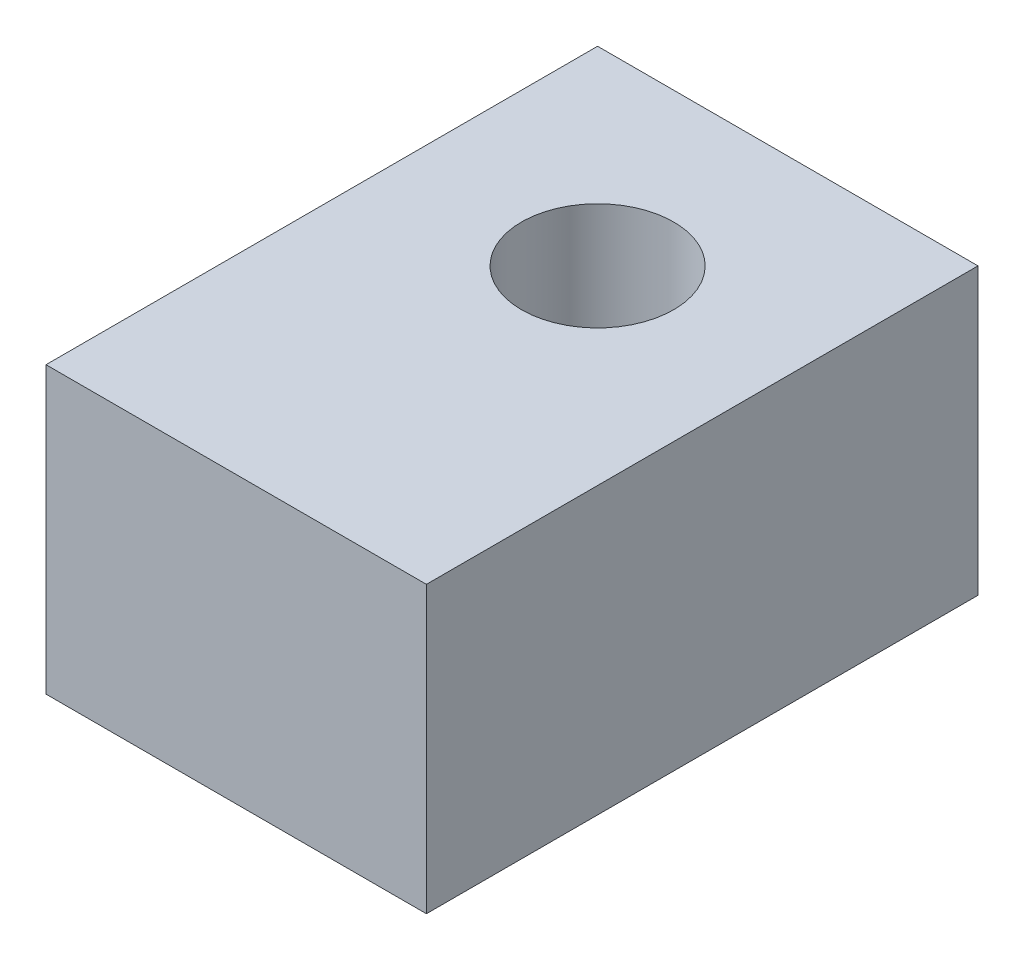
from build123d import *

# Parameters (mm, degrees)
CROQUIS1_W                         = 40
CROQUIS1_H                         = 30
EXTRUIR1_DEPTH                     = 58
TALADRO_DE_DI_METRO_DE_16_0_16_1_D = 16


with BuildPart() as part:
    # Croquis1 → Extruir1 (new body)
    with BuildSketch(Plane.XY):
        Rectangle(CROQUIS1_W, CROQUIS1_H)
    extrude(amount=EXTRUIR1_DEPTH)

    # Taladro de di_metro de _16.0 _16_1 (through all)
    with Locations(Plane(origin=(0, 15, 20), x_dir=(0, 0, 1), z_dir=(0, 1, 0))):
        with Locations((0, 0)):
            Hole(TALADRO_DE_DI_METRO_DE_16_0_16_1_D / 2)


solid = part.part
